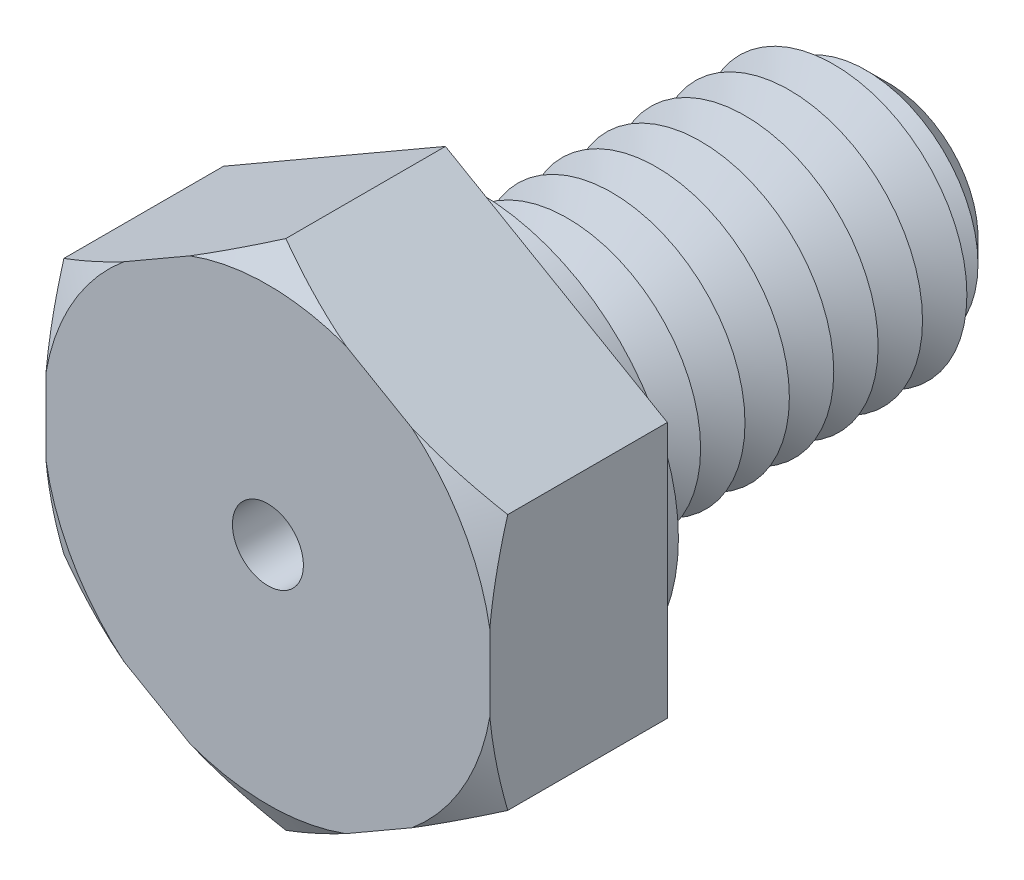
ISO-10303-21;
HEADER;
FILE_DESCRIPTION(('STEP AP214'),'2;1');
FILE_NAME('part.step','',(''),(''),'','','');
FILE_SCHEMA(('AUTOMOTIVE_DESIGN { 1 0 10303 214 1 1 1 1 }'));
ENDSEC;
DATA;
#1=APPLICATION_CONTEXT('core data for automotive mechanical design processes');
#2=APPLICATION_PROTOCOL_DEFINITION('international standard','automotive_design',2000,#1);
#3=PRODUCT_CONTEXT('',#1,'mechanical');
#4=PRODUCT('Part','Part','',(#3));
#5=PRODUCT_RELATED_PRODUCT_CATEGORY('part','',(#4));
#6=PRODUCT_DEFINITION_FORMATION('','',#4);
#7=PRODUCT_DEFINITION_CONTEXT('part definition',#1,'design');
#8=PRODUCT_DEFINITION('design','',#6,#7);
#9=PRODUCT_DEFINITION_SHAPE('','',#8);
#10=(LENGTH_UNIT() NAMED_UNIT(*) SI_UNIT(.MILLI.,.METRE.));
#11=(NAMED_UNIT(*) PLANE_ANGLE_UNIT() SI_UNIT($,.RADIAN.));
#12=(NAMED_UNIT(*) SI_UNIT($,.STERADIAN.) SOLID_ANGLE_UNIT());
#13=UNCERTAINTY_MEASURE_WITH_UNIT(LENGTH_MEASURE(1.E-05),#10,'distance_accuracy_value','');
#14=(GEOMETRIC_REPRESENTATION_CONTEXT(3) GLOBAL_UNCERTAINTY_ASSIGNED_CONTEXT((#13)) GLOBAL_UNIT_ASSIGNED_CONTEXT((#10,
#11,#12)) REPRESENTATION_CONTEXT('',''));
#15=CARTESIAN_POINT('',(0.,0.,0.));
#16=DIRECTION('',(0.,0.,1.));
#17=DIRECTION('',(1.,0.,0.));
#18=AXIS2_PLACEMENT_3D('',#15,#16,#17);
#19=CARTESIAN_POINT('',(5.,2.88675134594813,4.));
#20=DIRECTION('',(-0.5,-0.866025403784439,0.));
#21=DIRECTION('',(0.866025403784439,-0.5,0.));
#22=AXIS2_PLACEMENT_3D('',#19,#20,#21);
#23=PLANE('',#22);
#24=CARTESIAN_POINT('',(8.47277829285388,0.881741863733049,2.01100959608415));
#25=CARTESIAN_POINT('',(8.31567675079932,0.972444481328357,2.09578624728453));
#26=CARTESIAN_POINT('',(8.15819937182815,1.06336408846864,2.17964850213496));
#27=CARTESIAN_POINT('',(7.84233445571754,1.24572878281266,2.34511482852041));
#28=CARTESIAN_POINT('',(7.68394680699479,1.33717393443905,2.42671861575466));
#29=CARTESIAN_POINT('',(7.3656324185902,1.52095283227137,2.58747458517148));
#30=CARTESIAN_POINT('',(7.2057023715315,1.61328848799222,2.66661806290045));
#31=CARTESIAN_POINT('',(6.88464436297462,1.79865141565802,2.82158887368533));
#32=CARTESIAN_POINT('',(6.72351643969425,1.89167866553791,2.89741631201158));
#33=CARTESIAN_POINT('',(6.39574451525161,2.08091787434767,3.04691088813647));
#34=CARTESIAN_POINT('',(6.22906463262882,2.17715054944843,3.12047362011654));
#35=CARTESIAN_POINT('',(5.89404164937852,2.3705761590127,3.26235309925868));
#36=CARTESIAN_POINT('',(5.72569864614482,2.46776903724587,3.33067015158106));
#37=CARTESIAN_POINT('',(5.38728347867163,2.66315312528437,3.46077059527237));
#38=CARTESIAN_POINT('',(5.21721304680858,2.7613433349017,3.52255993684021));
#39=CARTESIAN_POINT('',(4.87507545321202,2.95887656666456,3.63817490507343));
#40=CARTESIAN_POINT('',(4.70300855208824,3.058219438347,3.69200155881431));
#41=CARTESIAN_POINT('',(4.29152467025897,3.29578976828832,3.8084273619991));
#42=CARTESIAN_POINT('',(4.05114917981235,3.43457062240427,3.86669526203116));
#43=CARTESIAN_POINT('',(3.68812002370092,3.64416560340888,3.93673911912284));
#44=CARTESIAN_POINT('',(3.56670137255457,3.71426669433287,3.95719387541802));
#45=CARTESIAN_POINT('',(3.32319777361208,3.85485356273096,3.99180309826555));
#46=CARTESIAN_POINT('',(3.20111291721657,3.92533928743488,4.0059584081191));
#47=CARTESIAN_POINT('',(2.95790980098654,4.06575267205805,4.0274398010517));
#48=CARTESIAN_POINT('',(2.83679666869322,4.13567737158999,4.03484289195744));
#49=CARTESIAN_POINT('',(2.59440145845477,4.27562431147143,4.04287861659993));
#50=CARTESIAN_POINT('',(2.47311938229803,4.34564655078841,4.0435113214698));
#51=CARTESIAN_POINT('',(2.23067249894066,4.48562332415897,4.03798617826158));
#52=CARTESIAN_POINT('',(2.10950769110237,4.55557785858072,4.03182836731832));
#53=CARTESIAN_POINT('',(1.86755304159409,4.695270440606,4.01290860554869));
#54=CARTESIAN_POINT('',(1.7467632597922,4.76500845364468,4.00014564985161));
#55=CARTESIAN_POINT('',(1.46148107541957,4.92971619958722,3.96252552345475));
#56=CARTESIAN_POINT('',(1.29725580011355,5.02453170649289,3.93494657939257));
#57=CARTESIAN_POINT('',(0.970375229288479,5.21325629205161,3.86938275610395));
#58=CARTESIAN_POINT('',(0.807720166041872,5.30716523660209,3.83139636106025));
#59=CARTESIAN_POINT('',(0.484000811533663,5.4940646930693,3.7464515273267));
#60=CARTESIAN_POINT('',(0.32293853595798,5.58705404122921,3.6994829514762));
#61=CARTESIAN_POINT('',(0.00262118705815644,5.77198934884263,3.59805355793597));
#62=CARTESIAN_POINT('',(-0.156634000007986,5.86393537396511,3.54359321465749));
#63=CARTESIAN_POINT('',(-0.475335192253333,6.04793759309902,3.42778810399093));
#64=CARTESIAN_POINT('',(-0.63476076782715,6.13998199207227,3.36636889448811));
#65=CARTESIAN_POINT('',(-0.951922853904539,6.3230956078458,3.2383676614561));
#66=CARTESIAN_POINT('',(-1.10966040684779,6.4141654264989,3.17178906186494));
#67=CARTESIAN_POINT('',(-1.42369760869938,6.59547488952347,3.03438397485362));
#68=CARTESIAN_POINT('',(-1.57999755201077,6.68571470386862,2.96355838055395));
#69=CARTESIAN_POINT('',(-1.89137153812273,6.86548655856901,2.81840247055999));
#70=CARTESIAN_POINT('',(-2.04644555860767,6.95501858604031,2.74407209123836));
#71=CARTESIAN_POINT('',(-2.30843737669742,7.1062796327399,2.61560341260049));
#72=CARTESIAN_POINT('',(-2.41563149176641,7.16816818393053,2.5622132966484));
#73=CARTESIAN_POINT('',(-2.62954890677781,7.29167346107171,2.45420118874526));
#74=CARTESIAN_POINT('',(-2.73627222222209,7.35329019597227,2.39957923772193));
#75=CARTESIAN_POINT('',(-2.94817046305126,7.4756297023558,2.28983212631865));
#76=CARTESIAN_POINT('',(-3.05334983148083,7.53635503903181,2.23471838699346));
#77=CARTESIAN_POINT('',(-3.26333506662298,7.65759007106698,2.12354428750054));
#78=CARTESIAN_POINT('',(-3.36814092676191,7.71809976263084,2.06748391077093));
#79=CARTESIAN_POINT('',(-3.47277829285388,7.77851217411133,2.01100959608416));
#80=B_SPLINE_CURVE_WITH_KNOTS('',3,(#24,#25,#26,#27,#28,#29,#30,#31,#32,#33,#34,#35,#36,#37,#38,
#39,#40,#41,#42,#43,#44,#45,#46,#47,#48,#49,#50,#51,#52,#53,#54,#55,#56,#57,#58,#59,#60,#61,#62,
#63,#64,#65,#66,#67,#68,#69,#70,#71,#72,#73,#74,#75,#76,#77,#78,#79),.UNSPECIFIED.,.F.,.F.,(4,2,
2,2,2,2,2,2,2,2,2,2,2,2,2,2,2,2,2,2,2,2,2,2,2,2,2,4),(0.,0.600718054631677,1.20151138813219,
1.80423204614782,2.40693355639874,3.02500509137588,3.64304064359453,4.26050788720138,
4.87789541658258,5.72780796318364,6.15275000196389,6.57763513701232,6.99761163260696,
7.41758371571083,7.83755350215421,8.25758719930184,8.83211758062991,9.40673168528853,
9.98199815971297,10.5572282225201,11.1393271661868,11.7210430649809,12.3026370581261,
12.8842416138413,13.2886376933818,13.6930203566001,14.0931288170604,14.493244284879),.UNSPECIFIED.);
#81=CARTESIAN_POINT('',(5.,2.88675134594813,3.59585481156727));
#82=VERTEX_POINT('',#81);
#83=CARTESIAN_POINT('',(3.24519941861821,3.89988593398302,4.));
#84=VERTEX_POINT('',#83);
#85=EDGE_CURVE('E132',#82,#84,#80,.T.);
#86=ORIENTED_EDGE('',*,*,#85,.F.);
#87=DIRECTION('',(0.,0.,-1.));
#88=VECTOR('',#87,1.);
#89=CARTESIAN_POINT('',(5.,2.88675134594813,4.));
#90=LINE('',#89,#88);
#91=CARTESIAN_POINT('',(5.,2.88675134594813,0.));
#92=VERTEX_POINT('',#91);
#93=EDGE_CURVE('E144',#82,#92,#90,.T.);
#94=ORIENTED_EDGE('',*,*,#93,.T.);
#95=DIRECTION('',(-0.866025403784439,0.5,0.));
#96=VECTOR('',#95,1.);
#97=CARTESIAN_POINT('',(5.,2.88675134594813,0.));
#98=LINE('',#97,#96);
#99=CARTESIAN_POINT('',(0.,5.77350269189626,0.));
#100=VERTEX_POINT('',#99);
#101=EDGE_CURVE('E273',#92,#100,#98,.T.);
#102=ORIENTED_EDGE('',*,*,#101,.T.);
#103=DIRECTION('',(0.,0.,-1.));
#104=VECTOR('',#103,1.);
#105=CARTESIAN_POINT('',(0.,5.77350269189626,4.));
#106=LINE('',#105,#104);
#107=CARTESIAN_POINT('',(0.,5.77350269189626,3.59585481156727));
#108=VERTEX_POINT('',#107);
#109=EDGE_CURVE('E179',#108,#100,#106,.T.);
#110=ORIENTED_EDGE('',*,*,#109,.F.);
#111=CARTESIAN_POINT('',(1.75480058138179,4.76036810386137,4.));
#112=VERTEX_POINT('',#111);
#113=EDGE_CURVE('E151',#112,#108,#80,.T.);
#114=ORIENTED_EDGE('',*,*,#113,.F.);
#115=DIRECTION('',(-0.866025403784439,0.5,0.));
#116=VECTOR('',#115,1.);
#117=CARTESIAN_POINT('',(5.,2.88675134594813,4.));
#118=LINE('',#117,#116);
#119=EDGE_CURVE('E148',#84,#112,#118,.T.);
#120=ORIENTED_EDGE('',*,*,#119,.F.);
#121=EDGE_LOOP('',(#86,#94,#102,#110,#114,#120));
#122=FACE_BOUND('',#121,.T.);
#123=ADVANCED_FACE('F39',(#122),#23,.F.);
#124=CARTESIAN_POINT('',(0.,5.77350269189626,4.));
#125=DIRECTION('',(0.5,-0.866025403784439,0.));
#126=DIRECTION('',(0.866025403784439,0.5,0.));
#127=AXIS2_PLACEMENT_3D('',#124,#125,#126);
#128=PLANE('',#127);
#129=CARTESIAN_POINT('',(3.47277829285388,7.77851217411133,2.01100959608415));
#130=CARTESIAN_POINT('',(3.31567675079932,7.68780955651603,2.09578624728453));
#131=CARTESIAN_POINT('',(3.15819937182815,7.59688994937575,2.17964850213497));
#132=CARTESIAN_POINT('',(2.84233445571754,7.41452525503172,2.34511482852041));
#133=CARTESIAN_POINT('',(2.68394680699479,7.32308010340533,2.42671861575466));
#134=CARTESIAN_POINT('',(2.36563241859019,7.13930120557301,2.58747458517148));
#135=CARTESIAN_POINT('',(2.2057023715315,7.04696554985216,2.66661806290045));
#136=CARTESIAN_POINT('',(1.88464436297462,6.86160262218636,2.82158887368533));
#137=CARTESIAN_POINT('',(1.72351643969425,6.76857537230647,2.89741631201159));
#138=CARTESIAN_POINT('',(1.39574451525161,6.57933616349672,3.04691088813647));
#139=CARTESIAN_POINT('',(1.22906463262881,6.48310348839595,3.12047362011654));
#140=CARTESIAN_POINT('',(0.894041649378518,6.28967787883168,3.26235309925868));
#141=CARTESIAN_POINT('',(0.725698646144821,6.19248500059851,3.33067015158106));
#142=CARTESIAN_POINT('',(0.38728347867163,5.99710091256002,3.46077059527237));
#143=CARTESIAN_POINT('',(0.217213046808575,5.89891070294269,3.52255993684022));
#144=CARTESIAN_POINT('',(-0.124924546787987,5.70137747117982,3.63817490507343));
#145=CARTESIAN_POINT('',(-0.296991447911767,5.60203459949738,3.69200155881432));
#146=CARTESIAN_POINT('',(-0.708475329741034,5.36446426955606,3.8084273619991));
#147=CARTESIAN_POINT('',(-0.948850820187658,5.22568341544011,3.86669526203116));
#148=CARTESIAN_POINT('',(-1.31187997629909,5.0160884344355,3.93673911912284));
#149=CARTESIAN_POINT('',(-1.43329862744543,4.94598734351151,3.95719387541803));
#150=CARTESIAN_POINT('',(-1.67680222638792,4.80540047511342,3.99180309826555));
#151=CARTESIAN_POINT('',(-1.79888708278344,4.7349147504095,4.0059584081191));
#152=CARTESIAN_POINT('',(-2.04209019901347,4.59450136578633,4.0274398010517));
#153=CARTESIAN_POINT('',(-2.16320333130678,4.52457666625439,4.03484289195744));
#154=CARTESIAN_POINT('',(-2.40559854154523,4.38462972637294,4.04287861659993));
#155=CARTESIAN_POINT('',(-2.52688061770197,4.31460748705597,4.04351132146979));
#156=CARTESIAN_POINT('',(-2.76932750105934,4.17463071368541,4.03798617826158));
#157=CARTESIAN_POINT('',(-2.89049230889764,4.10467617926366,4.03182836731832));
#158=CARTESIAN_POINT('',(-3.13244695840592,3.96498359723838,4.01290860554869));
#159=CARTESIAN_POINT('',(-3.25323674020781,3.8952455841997,4.00014564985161));
#160=CARTESIAN_POINT('',(-3.53851892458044,3.73053783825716,3.96252552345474));
#161=CARTESIAN_POINT('',(-3.70274419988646,3.63572233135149,3.93494657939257));
#162=CARTESIAN_POINT('',(-4.02962477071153,3.44699774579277,3.86938275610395));
#163=CARTESIAN_POINT('',(-4.19227983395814,3.35308880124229,3.83139636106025));
#164=CARTESIAN_POINT('',(-4.51599918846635,3.16618934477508,3.7464515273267));
#165=CARTESIAN_POINT('',(-4.67706146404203,3.07319999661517,3.6994829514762));
#166=CARTESIAN_POINT('',(-4.99737881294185,2.88826468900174,3.59805355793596));
#167=CARTESIAN_POINT('',(-5.156634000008,2.79631866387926,3.54359321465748));
#168=CARTESIAN_POINT('',(-5.47533519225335,2.61231644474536,3.42778810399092));
#169=CARTESIAN_POINT('',(-5.63476076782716,2.5202720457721,3.3663688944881));
#170=CARTESIAN_POINT('',(-5.95192285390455,2.33715842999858,3.23836766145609));
#171=CARTESIAN_POINT('',(-6.10966040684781,2.24608861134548,3.17178906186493));
#172=CARTESIAN_POINT('',(-6.4236976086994,2.0647791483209,3.03438397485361));
#173=CARTESIAN_POINT('',(-6.57999755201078,1.97453933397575,2.96355838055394));
#174=CARTESIAN_POINT('',(-6.89137153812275,1.79476747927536,2.81840247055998));
#175=CARTESIAN_POINT('',(-7.04644555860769,1.70523545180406,2.74407209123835));
#176=CARTESIAN_POINT('',(-7.30843737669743,1.55397440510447,2.61560341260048));
#177=CARTESIAN_POINT('',(-7.41563149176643,1.49208585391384,2.56221329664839));
#178=CARTESIAN_POINT('',(-7.62954890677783,1.36858057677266,2.45420118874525));
#179=CARTESIAN_POINT('',(-7.7362722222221,1.30696384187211,2.39957923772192));
#180=CARTESIAN_POINT('',(-7.94817046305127,1.18462433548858,2.28983212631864));
#181=CARTESIAN_POINT('',(-8.05334983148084,1.12389899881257,2.23471838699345));
#182=CARTESIAN_POINT('',(-8.26333506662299,1.0026639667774,2.12354428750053));
#183=CARTESIAN_POINT('',(-8.36814092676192,0.94215427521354,2.06748391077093));
#184=CARTESIAN_POINT('',(-8.47277829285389,0.881741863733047,2.01100959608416));
#185=B_SPLINE_CURVE_WITH_KNOTS('',3,(#129,#130,#131,#132,#133,#134,#135,#136,#137,#138,#139,
#140,#141,#142,#143,#144,#145,#146,#147,#148,#149,#150,#151,#152,#153,#154,#155,#156,#157,#158,
#159,#160,#161,#162,#163,#164,#165,#166,#167,#168,#169,#170,#171,#172,#173,#174,#175,#176,#177,
#178,#179,#180,#181,#182,#183,#184),.UNSPECIFIED.,.F.,.F.,(4,2,2,2,2,2,2,2,2,2,2,2,2,2,2,2,2,2,
2,2,2,2,2,2,2,2,2,4),(0.,0.600718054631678,1.20151138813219,1.80423204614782,2.40693355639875,
3.02500509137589,3.64304064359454,4.26050788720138,4.87789541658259,5.72780796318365,
6.1527500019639,6.57763513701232,6.99761163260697,7.41758371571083,7.83755350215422,
8.25758719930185,8.83211758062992,9.40673168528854,9.98199815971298,10.5572282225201,
11.1393271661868,11.7210430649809,12.3026370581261,12.8842416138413,13.2886376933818,
13.6930203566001,14.0931288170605,14.493244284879),.UNSPECIFIED.);
#186=CARTESIAN_POINT('',(-1.75480058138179,4.76036810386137,4.));
#187=VERTEX_POINT('',#186);
#188=EDGE_CURVE('E313',#108,#187,#185,.T.);
#189=ORIENTED_EDGE('',*,*,#188,.F.);
#190=ORIENTED_EDGE('',*,*,#109,.T.);
#191=DIRECTION('',(-0.866025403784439,-0.5,0.));
#192=VECTOR('',#191,1.);
#193=CARTESIAN_POINT('',(0.,5.77350269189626,0.));
#194=LINE('',#193,#192);
#195=CARTESIAN_POINT('',(-5.,2.88675134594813,0.));
#196=VERTEX_POINT('',#195);
#197=EDGE_CURVE('E293',#100,#196,#194,.T.);
#198=ORIENTED_EDGE('',*,*,#197,.T.);
#199=DIRECTION('',(0.,0.,-1.));
#200=VECTOR('',#199,1.);
#201=CARTESIAN_POINT('',(-5.,2.88675134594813,4.));
#202=LINE('',#201,#200);
#203=CARTESIAN_POINT('',(-5.,2.88675134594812,3.59585481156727));
#204=VERTEX_POINT('',#203);
#205=EDGE_CURVE('E176',#204,#196,#202,.T.);
#206=ORIENTED_EDGE('',*,*,#205,.F.);
#207=CARTESIAN_POINT('',(-3.24519941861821,3.89988593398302,4.));
#208=VERTEX_POINT('',#207);
#209=EDGE_CURVE('E389',#208,#204,#185,.T.);
#210=ORIENTED_EDGE('',*,*,#209,.F.);
#211=DIRECTION('',(-0.866025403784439,-0.5,0.));
#212=VECTOR('',#211,1.);
#213=CARTESIAN_POINT('',(0.,5.77350269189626,4.));
#214=LINE('',#213,#212);
#215=EDGE_CURVE('E276',#187,#208,#214,.T.);
#216=ORIENTED_EDGE('',*,*,#215,.F.);
#217=EDGE_LOOP('',(#189,#190,#198,#206,#210,#216));
#218=FACE_BOUND('',#217,.T.);
#219=ADVANCED_FACE('F383',(#218),#128,.F.);
#220=CARTESIAN_POINT('',(-5.,2.88675134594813,4.));
#221=DIRECTION('',(1.,0.,0.));
#222=DIRECTION('',(0.,0.,-1.));
#223=AXIS2_PLACEMENT_3D('',#220,#221,#222);
#224=PLANE('',#223);
#225=CARTESIAN_POINT('',(-5.,6.35952963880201,2.25858442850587));
#226=CARTESIAN_POINT('',(-5.,6.17888675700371,2.34055079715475));
#227=CARTESIAN_POINT('',(-5.,5.99774985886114,2.42144915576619));
#228=CARTESIAN_POINT('',(-5.,5.63427640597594,2.58059164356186));
#229=CARTESIAN_POINT('',(-5.,5.45193964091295,2.65883529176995));
#230=CARTESIAN_POINT('',(-5.,5.08515575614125,2.81244019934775));
#231=CARTESIAN_POINT('',(-5.,4.90070300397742,2.8877880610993));
#232=CARTESIAN_POINT('',(-5.,4.53023851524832,3.0345384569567));
#233=CARTESIAN_POINT('',(-5.,4.34422685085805,3.10594117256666));
#234=CARTESIAN_POINT('',(-5.,3.9712497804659,3.24361472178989));
#235=CARTESIAN_POINT('',(-5.,3.78429235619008,3.30990707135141));
#236=CARTESIAN_POINT('',(-5.,3.40837814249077,3.43663614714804));
#237=CARTESIAN_POINT('',(-5.,3.21942124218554,3.49707254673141));
#238=CARTESIAN_POINT('',(-5.,2.83960832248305,3.61070280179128));
#239=CARTESIAN_POINT('',(-5.,2.64875526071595,3.66390646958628));
#240=CARTESIAN_POINT('',(-5.,2.26482213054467,3.76165698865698));
#241=CARTESIAN_POINT('',(-5.,2.07174215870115,3.80620421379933));
#242=CARTESIAN_POINT('',(-5.,1.7384332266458,3.87385543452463));
#243=CARTESIAN_POINT('',(-5.,1.59871159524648,3.89946008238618));
#244=CARTESIAN_POINT('',(-5.,1.31833206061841,3.94478995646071));
#245=CARTESIAN_POINT('',(-5.,1.17767431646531,3.96451615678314));
#246=CARTESIAN_POINT('',(-5.,0.895629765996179,3.99757345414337));
#247=CARTESIAN_POINT('',(-5.,0.754243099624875,4.01090573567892));
#248=CARTESIAN_POINT('',(-5.,0.470989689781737,4.03079351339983));
#249=CARTESIAN_POINT('',(-5.,0.329122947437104,4.03734902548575));
#250=CARTESIAN_POINT('',(-5.,0.0453101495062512,4.04347876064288));
#251=CARTESIAN_POINT('',(-5.,-0.0966358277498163,4.04305657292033));
#252=CARTESIAN_POINT('',(-5.,-0.380333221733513,4.03525341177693));
#253=CARTESIAN_POINT('',(-5.,-0.522084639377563,4.02787247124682));
#254=CARTESIAN_POINT('',(-5.,-0.805078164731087,4.00637695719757));
#255=CARTESIAN_POINT('',(-5.,-0.946320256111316,3.99226216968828));
#256=CARTESIAN_POINT('',(-5.,-1.22803871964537,3.95770663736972));
#257=CARTESIAN_POINT('',(-5.,-1.36851494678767,3.93726473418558));
#258=CARTESIAN_POINT('',(-5.,-1.92842653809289,3.84388033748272));
#259=CARTESIAN_POINT('',(-5.,-2.34409397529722,3.74768165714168));
#260=CARTESIAN_POINT('',(-5.,-2.95991397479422,3.57615402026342));
#261=CARTESIAN_POINT('',(-5.,-3.16417440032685,3.51433916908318));
#262=CARTESIAN_POINT('',(-5.,-3.57033913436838,3.3833457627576));
#263=CARTESIAN_POINT('',(-5.,-3.77224360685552,3.31416772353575));
#264=CARTESIAN_POINT('',(-5.,-4.17620397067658,3.16907432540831));
#265=CARTESIAN_POINT('',(-5.,-4.37823505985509,3.09309081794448));
#266=CARTESIAN_POINT('',(-5.,-4.78041106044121,2.93626257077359));
#267=CARTESIAN_POINT('',(-5.,-4.98055585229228,2.85541752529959));
#268=CARTESIAN_POINT('',(-5.,-5.37797431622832,2.69033488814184));
#269=CARTESIAN_POINT('',(-5.,-5.57525810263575,2.60612151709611));
#270=CARTESIAN_POINT('',(-5.,-5.96839598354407,2.43454627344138));
#271=CARTESIAN_POINT('',(-5.,-6.16425041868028,2.34718518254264));
#272=CARTESIAN_POINT('',(-5.,-6.35952963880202,2.25858442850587));
#273=B_SPLINE_CURVE_WITH_KNOTS('',3,(#225,#226,#227,#228,#229,#230,#231,#232,#233,#234,#235,
#236,#237,#238,#239,#240,#241,#242,#243,#244,#245,#246,#247,#248,#249,#250,#251,#252,#253,#254,
#255,#256,#257,#258,#259,#260,#261,#262,#263,#264,#265,#266,#267,#268,#269,#270,#271,#272),
.UNSPECIFIED.,.F.,.F.,(4,2,2,2,2,2,2,2,2,2,2,2,2,2,2,2,2,2,2,2,2,2,2,4),(0.,0.595116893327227,
1.19034103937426,1.78805021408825,2.3857318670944,2.98074146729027,3.57578423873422,
4.17001151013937,4.7642131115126,5.19024951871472,5.61621528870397,6.0421021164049,
6.46798794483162,6.89365471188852,7.3193194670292,7.74499774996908,8.17075401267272,
9.44769357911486,10.0878733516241,10.7280082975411,11.3754821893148,12.0229968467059,
12.6664852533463,13.3098149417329),.UNSPECIFIED.);
#274=CARTESIAN_POINT('',(-5.,0.86048216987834,4.));
#275=VERTEX_POINT('',#274);
#276=EDGE_CURVE('E394',#204,#275,#273,.T.);
#277=ORIENTED_EDGE('',*,*,#276,.F.);
#278=ORIENTED_EDGE('',*,*,#205,.T.);
#279=DIRECTION('',(0.,-1.,0.));
#280=VECTOR('',#279,1.);
#281=CARTESIAN_POINT('',(-5.,2.88675134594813,0.));
#282=LINE('',#281,#280);
#283=CARTESIAN_POINT('',(-5.,-2.88675134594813,0.));
#284=VERTEX_POINT('',#283);
#285=EDGE_CURVE('E297',#196,#284,#282,.T.);
#286=ORIENTED_EDGE('',*,*,#285,.T.);
#287=DIRECTION('',(0.,0.,-1.));
#288=VECTOR('',#287,1.);
#289=CARTESIAN_POINT('',(-5.,-2.88675134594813,4.));
#290=LINE('',#289,#288);
#291=CARTESIAN_POINT('',(-4.99999999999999,-2.88675134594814,3.59585481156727));
#292=VERTEX_POINT('',#291);
#293=EDGE_CURVE('E173',#292,#284,#290,.T.);
#294=ORIENTED_EDGE('',*,*,#293,.F.);
#295=CARTESIAN_POINT('',(-5.,-0.86048216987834,4.));
#296=VERTEX_POINT('',#295);
#297=EDGE_CURVE('E316',#296,#292,#273,.T.);
#298=ORIENTED_EDGE('',*,*,#297,.F.);
#299=DIRECTION('',(0.,-1.,0.));
#300=VECTOR('',#299,1.);
#301=CARTESIAN_POINT('',(-5.,2.88675134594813,4.));
#302=LINE('',#301,#300);
#303=EDGE_CURVE('E280',#275,#296,#302,.T.);
#304=ORIENTED_EDGE('',*,*,#303,.F.);
#305=EDGE_LOOP('',(#277,#278,#286,#294,#298,#304));
#306=FACE_BOUND('',#305,.T.);
#307=ADVANCED_FACE('F386',(#306),#224,.F.);
#308=CARTESIAN_POINT('',(-5.,-2.88675134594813,4.));
#309=DIRECTION('',(0.5,0.866025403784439,0.));
#310=DIRECTION('',(-0.866025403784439,0.5,0.));
#311=AXIS2_PLACEMENT_3D('',#308,#309,#310);
#312=PLANE('',#311);
#313=CARTESIAN_POINT('',(-8.47277829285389,-0.881741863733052,2.01100959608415));
#314=CARTESIAN_POINT('',(-8.31567675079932,-0.972444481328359,2.09578624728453));
#315=CARTESIAN_POINT('',(-8.15819937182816,-1.06336408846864,2.17964850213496));
#316=CARTESIAN_POINT('',(-7.84233445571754,-1.24572878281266,2.34511482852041));
#317=CARTESIAN_POINT('',(-7.68394680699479,-1.33717393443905,2.42671861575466));
#318=CARTESIAN_POINT('',(-7.3656324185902,-1.52095283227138,2.58747458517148));
#319=CARTESIAN_POINT('',(-7.2057023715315,-1.61328848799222,2.66661806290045));
#320=CARTESIAN_POINT('',(-6.88464436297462,-1.79865141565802,2.82158887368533));
#321=CARTESIAN_POINT('',(-6.72351643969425,-1.89167866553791,2.89741631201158));
#322=CARTESIAN_POINT('',(-6.39574451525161,-2.08091787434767,3.04691088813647));
#323=CARTESIAN_POINT('',(-6.22906463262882,-2.17715054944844,3.12047362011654));
#324=CARTESIAN_POINT('',(-5.89404164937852,-2.37057615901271,3.26235309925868));
#325=CARTESIAN_POINT('',(-5.72569864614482,-2.46776903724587,3.33067015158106));
#326=CARTESIAN_POINT('',(-5.38728347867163,-2.66315312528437,3.46077059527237));
#327=CARTESIAN_POINT('',(-5.21721304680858,-2.7613433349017,3.52255993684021));
#328=CARTESIAN_POINT('',(-4.87507545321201,-2.95887656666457,3.63817490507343));
#329=CARTESIAN_POINT('',(-4.70300855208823,-3.05821943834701,3.69200155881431));
#330=CARTESIAN_POINT('',(-4.29152467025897,-3.29578976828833,3.8084273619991));
#331=CARTESIAN_POINT('',(-4.05114917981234,-3.43457062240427,3.86669526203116));
#332=CARTESIAN_POINT('',(-3.68812002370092,-3.64416560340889,3.93673911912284));
#333=CARTESIAN_POINT('',(-3.56670137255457,-3.71426669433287,3.95719387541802));
#334=CARTESIAN_POINT('',(-3.32319777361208,-3.85485356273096,3.99180309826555));
#335=CARTESIAN_POINT('',(-3.20111291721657,-3.92533928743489,4.0059584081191));
#336=CARTESIAN_POINT('',(-2.95790980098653,-4.06575267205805,4.0274398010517));
#337=CARTESIAN_POINT('',(-2.83679666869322,-4.13567737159,4.03484289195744));
#338=CARTESIAN_POINT('',(-2.59440145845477,-4.27562431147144,4.04287861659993));
#339=CARTESIAN_POINT('',(-2.47311938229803,-4.34564655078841,4.04351132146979));
#340=CARTESIAN_POINT('',(-2.23067249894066,-4.48562332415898,4.03798617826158));
#341=CARTESIAN_POINT('',(-2.10950769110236,-4.55557785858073,4.03182836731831));
#342=CARTESIAN_POINT('',(-1.86755304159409,-4.69527044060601,4.01290860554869));
#343=CARTESIAN_POINT('',(-1.74676325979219,-4.76500845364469,4.00014564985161));
#344=CARTESIAN_POINT('',(-1.46148107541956,-4.92971619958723,3.96252552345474));
#345=CARTESIAN_POINT('',(-1.29725580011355,-5.0245317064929,3.93494657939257));
#346=CARTESIAN_POINT('',(-0.970375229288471,-5.21325629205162,3.86938275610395));
#347=CARTESIAN_POINT('',(-0.807720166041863,-5.3071652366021,3.83139636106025));
#348=CARTESIAN_POINT('',(-0.484000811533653,-5.49406469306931,3.7464515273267));
#349=CARTESIAN_POINT('',(-0.322938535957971,-5.58705404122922,3.6994829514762));
#350=CARTESIAN_POINT('',(-0.00262118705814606,-5.77198934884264,3.59805355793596));
#351=CARTESIAN_POINT('',(0.156634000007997,-5.86393537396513,3.54359321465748));
#352=CARTESIAN_POINT('',(0.475335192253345,-6.04793759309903,3.42778810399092));
#353=CARTESIAN_POINT('',(0.634760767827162,-6.13998199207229,3.3663688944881));
#354=CARTESIAN_POINT('',(0.951922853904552,-6.32309560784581,3.23836766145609));
#355=CARTESIAN_POINT('',(1.10966040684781,-6.41416542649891,3.17178906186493));
#356=CARTESIAN_POINT('',(1.4236976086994,-6.59547488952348,3.03438397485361));
#357=CARTESIAN_POINT('',(1.57999755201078,-6.68571470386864,2.96355838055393));
#358=CARTESIAN_POINT('',(1.89137153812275,-6.86548655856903,2.81840247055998));
#359=CARTESIAN_POINT('',(2.04644555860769,-6.95501858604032,2.74407209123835));
#360=CARTESIAN_POINT('',(2.30843737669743,-7.10627963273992,2.61560341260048));
#361=CARTESIAN_POINT('',(2.41563149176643,-7.16816818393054,2.56221329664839));
#362=CARTESIAN_POINT('',(2.62954890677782,-7.29167346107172,2.45420118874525));
#363=CARTESIAN_POINT('',(2.73627222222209,-7.35329019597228,2.39957923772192));
#364=CARTESIAN_POINT('',(2.94817046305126,-7.47562970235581,2.28983212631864));
#365=CARTESIAN_POINT('',(3.05334983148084,-7.53635503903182,2.23471838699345));
#366=CARTESIAN_POINT('',(3.26333506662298,-7.65759007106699,2.12354428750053));
#367=CARTESIAN_POINT('',(3.36814092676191,-7.71809976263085,2.06748391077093));
#368=CARTESIAN_POINT('',(3.47277829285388,-7.77851217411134,2.01100959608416));
#369=B_SPLINE_CURVE_WITH_KNOTS('',3,(#313,#314,#315,#316,#317,#318,#319,#320,#321,#322,#323,
#324,#325,#326,#327,#328,#329,#330,#331,#332,#333,#334,#335,#336,#337,#338,#339,#340,#341,#342,
#343,#344,#345,#346,#347,#348,#349,#350,#351,#352,#353,#354,#355,#356,#357,#358,#359,#360,#361,
#362,#363,#364,#365,#366,#367,#368),.UNSPECIFIED.,.F.,.F.,(4,2,2,2,2,2,2,2,2,2,2,2,2,2,2,2,2,2,
2,2,2,2,2,2,2,2,2,4),(0.,0.600718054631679,1.20151138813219,1.80423204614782,2.40693355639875,
3.02500509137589,3.64304064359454,4.26050788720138,4.87789541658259,5.72780796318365,
6.1527500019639,6.57763513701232,6.99761163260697,7.41758371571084,7.83755350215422,
8.25758719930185,8.83211758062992,9.40673168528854,9.98199815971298,10.5572282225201,
11.1393271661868,11.7210430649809,12.3026370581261,12.8842416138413,13.2886376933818,
13.6930203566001,14.0931288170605,14.493244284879),.UNSPECIFIED.);
#370=CARTESIAN_POINT('',(-3.24519941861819,-3.89988593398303,4.));
#371=VERTEX_POINT('',#370);
#372=EDGE_CURVE('E315',#292,#371,#369,.T.);
#373=ORIENTED_EDGE('',*,*,#372,.F.);
#374=ORIENTED_EDGE('',*,*,#293,.T.);
#375=DIRECTION('',(0.866025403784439,-0.5,0.));
#376=VECTOR('',#375,1.);
#377=CARTESIAN_POINT('',(-5.,-2.88675134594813,0.));
#378=LINE('',#377,#376);
#379=CARTESIAN_POINT('',(0.,-5.77350269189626,0.));
#380=VERTEX_POINT('',#379);
#381=EDGE_CURVE('E301',#284,#380,#378,.T.);
#382=ORIENTED_EDGE('',*,*,#381,.T.);
#383=DIRECTION('',(0.,0.,-1.));
#384=VECTOR('',#383,1.);
#385=CARTESIAN_POINT('',(0.,-5.77350269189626,4.));
#386=LINE('',#385,#384);
#387=CARTESIAN_POINT('',(0.,-5.77350269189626,3.59585481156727));
#388=VERTEX_POINT('',#387);
#389=EDGE_CURVE('E163',#388,#380,#386,.T.);
#390=ORIENTED_EDGE('',*,*,#389,.F.);
#391=CARTESIAN_POINT('',(-1.75480058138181,-4.76036810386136,4.));
#392=VERTEX_POINT('',#391);
#393=EDGE_CURVE('E317',#392,#388,#369,.T.);
#394=ORIENTED_EDGE('',*,*,#393,.F.);
#395=DIRECTION('',(0.866025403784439,-0.5,0.));
#396=VECTOR('',#395,1.);
#397=CARTESIAN_POINT('',(-5.,-2.88675134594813,4.));
#398=LINE('',#397,#396);
#399=EDGE_CURVE('E284',#371,#392,#398,.T.);
#400=ORIENTED_EDGE('',*,*,#399,.F.);
#401=EDGE_LOOP('',(#373,#374,#382,#390,#394,#400));
#402=FACE_BOUND('',#401,.T.);
#403=ADVANCED_FACE('F337',(#402),#312,.F.);
#404=CARTESIAN_POINT('',(0.,-5.77350269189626,4.));
#405=DIRECTION('',(-0.5,0.866025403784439,0.));
#406=DIRECTION('',(-0.866025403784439,-0.5,0.));
#407=AXIS2_PLACEMENT_3D('',#404,#405,#406);
#408=PLANE('',#407);
#409=CARTESIAN_POINT('',(-3.47277829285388,-7.77851217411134,2.01100959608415));
#410=CARTESIAN_POINT('',(-3.31567675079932,-7.68780955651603,2.09578624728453));
#411=CARTESIAN_POINT('',(-3.15819937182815,-7.59688994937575,2.17964850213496));
#412=CARTESIAN_POINT('',(-2.84233445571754,-7.41452525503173,2.34511482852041));
#413=CARTESIAN_POINT('',(-2.68394680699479,-7.32308010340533,2.42671861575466));
#414=CARTESIAN_POINT('',(-2.36563241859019,-7.13930120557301,2.58747458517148));
#415=CARTESIAN_POINT('',(-2.2057023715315,-7.04696554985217,2.66661806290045));
#416=CARTESIAN_POINT('',(-1.88464436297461,-6.86160262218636,2.82158887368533));
#417=CARTESIAN_POINT('',(-1.72351643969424,-6.76857537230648,2.89741631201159));
#418=CARTESIAN_POINT('',(-1.39574451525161,-6.57933616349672,3.04691088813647));
#419=CARTESIAN_POINT('',(-1.22906463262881,-6.48310348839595,3.12047362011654));
#420=CARTESIAN_POINT('',(-0.894041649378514,-6.28967787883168,3.26235309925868));
#421=CARTESIAN_POINT('',(-0.725698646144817,-6.19248500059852,3.33067015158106));
#422=CARTESIAN_POINT('',(-0.387283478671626,-5.99710091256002,3.46077059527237));
#423=CARTESIAN_POINT('',(-0.217213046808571,-5.89891070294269,3.52255993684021));
#424=CARTESIAN_POINT('',(0.124924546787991,-5.70137747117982,3.63817490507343));
#425=CARTESIAN_POINT('',(0.296991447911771,-5.60203459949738,3.69200155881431));
#426=CARTESIAN_POINT('',(0.708475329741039,-5.36446426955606,3.8084273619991));
#427=CARTESIAN_POINT('',(0.948850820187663,-5.22568341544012,3.86669526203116));
#428=CARTESIAN_POINT('',(1.31187997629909,-5.0160884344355,3.93673911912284));
#429=CARTESIAN_POINT('',(1.43329862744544,-4.94598734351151,3.95719387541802));
#430=CARTESIAN_POINT('',(1.67680222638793,-4.80540047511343,3.99180309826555));
#431=CARTESIAN_POINT('',(1.79888708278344,-4.7349147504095,4.0059584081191));
#432=CARTESIAN_POINT('',(2.04209019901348,-4.59450136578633,4.0274398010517));
#433=CARTESIAN_POINT('',(2.16320333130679,-4.52457666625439,4.03484289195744));
#434=CARTESIAN_POINT('',(2.40559854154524,-4.38462972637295,4.04287861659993));
#435=CARTESIAN_POINT('',(2.52688061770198,-4.31460748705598,4.04351132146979));
#436=CARTESIAN_POINT('',(2.76932750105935,-4.17463071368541,4.03798617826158));
#437=CARTESIAN_POINT('',(2.89049230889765,-4.10467617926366,4.03182836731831));
#438=CARTESIAN_POINT('',(3.13244695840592,-3.96498359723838,4.01290860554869));
#439=CARTESIAN_POINT('',(3.25323674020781,-3.8952455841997,4.00014564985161));
#440=CARTESIAN_POINT('',(3.53851892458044,-3.73053783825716,3.96252552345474));
#441=CARTESIAN_POINT('',(3.70274419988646,-3.63572233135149,3.93494657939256));
#442=CARTESIAN_POINT('',(4.02962477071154,-3.44699774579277,3.86938275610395));
#443=CARTESIAN_POINT('',(4.19227983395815,-3.35308880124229,3.83139636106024));
#444=CARTESIAN_POINT('',(4.51599918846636,-3.16618934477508,3.7464515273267));
#445=CARTESIAN_POINT('',(4.67706146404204,-3.07319999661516,3.69948295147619));
#446=CARTESIAN_POINT('',(4.99737881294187,-2.88826468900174,3.59805355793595));
#447=CARTESIAN_POINT('',(5.15663400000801,-2.79631866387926,3.54359321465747));
#448=CARTESIAN_POINT('',(5.47533519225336,-2.61231644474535,3.42778810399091));
#449=CARTESIAN_POINT('',(5.63476076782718,-2.5202720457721,3.3663688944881));
#450=CARTESIAN_POINT('',(5.95192285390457,-2.33715842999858,3.23836766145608));
#451=CARTESIAN_POINT('',(6.10966040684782,-2.24608861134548,3.17178906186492));
#452=CARTESIAN_POINT('',(6.42369760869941,-2.0647791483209,3.0343839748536));
#453=CARTESIAN_POINT('',(6.5799975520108,-1.97453933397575,2.96355838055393));
#454=CARTESIAN_POINT('',(6.89137153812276,-1.79476747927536,2.81840247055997));
#455=CARTESIAN_POINT('',(7.04644555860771,-1.70523545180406,2.74407209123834));
#456=CARTESIAN_POINT('',(7.30843737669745,-1.55397440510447,2.61560341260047));
#457=CARTESIAN_POINT('',(7.41563149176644,-1.49208585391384,2.56221329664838));
#458=CARTESIAN_POINT('',(7.62954890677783,-1.36858057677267,2.45420118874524));
#459=CARTESIAN_POINT('',(7.7362722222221,-1.30696384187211,2.39957923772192));
#460=CARTESIAN_POINT('',(7.94817046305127,-1.18462433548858,2.28983212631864));
#461=CARTESIAN_POINT('',(8.05334983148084,-1.12389899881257,2.23471838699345));
#462=CARTESIAN_POINT('',(8.26333506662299,-1.00266396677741,2.12354428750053));
#463=CARTESIAN_POINT('',(8.36814092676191,-0.942154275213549,2.06748391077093));
#464=CARTESIAN_POINT('',(8.47277829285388,-0.881741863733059,2.01100959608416));
#465=B_SPLINE_CURVE_WITH_KNOTS('',3,(#409,#410,#411,#412,#413,#414,#415,#416,#417,#418,#419,
#420,#421,#422,#423,#424,#425,#426,#427,#428,#429,#430,#431,#432,#433,#434,#435,#436,#437,#438,
#439,#440,#441,#442,#443,#444,#445,#446,#447,#448,#449,#450,#451,#452,#453,#454,#455,#456,#457,
#458,#459,#460,#461,#462,#463,#464),.UNSPECIFIED.,.F.,.F.,(4,2,2,2,2,2,2,2,2,2,2,2,2,2,2,2,2,2,
2,2,2,2,2,2,2,2,2,4),(0.,0.600718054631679,1.20151138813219,1.80423204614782,2.40693355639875,
3.02500509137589,3.64304064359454,4.26050788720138,4.87789541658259,5.72780796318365,
6.1527500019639,6.57763513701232,6.99761163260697,7.41758371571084,7.83755350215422,
8.25758719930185,8.83211758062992,9.40673168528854,9.98199815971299,10.5572282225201,
11.1393271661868,11.7210430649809,12.3026370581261,12.8842416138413,13.2886376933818,
13.6930203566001,14.0931288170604,14.493244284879),.UNSPECIFIED.);
#466=CARTESIAN_POINT('',(1.75480058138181,-4.76036810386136,4.));
#467=VERTEX_POINT('',#466);
#468=EDGE_CURVE('E64',#388,#467,#465,.T.);
#469=ORIENTED_EDGE('',*,*,#468,.F.);
#470=ORIENTED_EDGE('',*,*,#389,.T.);
#471=DIRECTION('',(0.866025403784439,0.5,0.));
#472=VECTOR('',#471,1.);
#473=CARTESIAN_POINT('',(0.,-5.77350269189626,0.));
#474=LINE('',#473,#472);
#475=CARTESIAN_POINT('',(5.,-2.88675134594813,0.));
#476=VERTEX_POINT('',#475);
#477=EDGE_CURVE('E304',#380,#476,#474,.T.);
#478=ORIENTED_EDGE('',*,*,#477,.T.);
#479=DIRECTION('',(0.,0.,-1.));
#480=VECTOR('',#479,1.);
#481=CARTESIAN_POINT('',(5.,-2.88675134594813,4.));
#482=LINE('',#481,#480);
#483=CARTESIAN_POINT('',(5.,-2.88675134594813,3.59585481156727));
#484=VERTEX_POINT('',#483);
#485=EDGE_CURVE('E157',#484,#476,#482,.T.);
#486=ORIENTED_EDGE('',*,*,#485,.F.);
#487=CARTESIAN_POINT('',(3.24519941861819,-3.89988593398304,4.));
#488=VERTEX_POINT('',#487);
#489=EDGE_CURVE('E323',#488,#484,#465,.T.);
#490=ORIENTED_EDGE('',*,*,#489,.F.);
#491=DIRECTION('',(0.866025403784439,0.5,0.));
#492=VECTOR('',#491,1.);
#493=CARTESIAN_POINT('',(0.,-5.77350269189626,4.));
#494=LINE('',#493,#492);
#495=EDGE_CURVE('E166',#467,#488,#494,.T.);
#496=ORIENTED_EDGE('',*,*,#495,.F.);
#497=EDGE_LOOP('',(#469,#470,#478,#486,#490,#496));
#498=FACE_BOUND('',#497,.T.);
#499=ADVANCED_FACE('F433',(#498),#408,.F.);
#500=CARTESIAN_POINT('',(5.,-2.88675134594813,4.));
#501=DIRECTION('',(-1.,0.,0.));
#502=DIRECTION('',(0.,-1.,0.));
#503=AXIS2_PLACEMENT_3D('',#500,#501,#502);
#504=PLANE('',#503);
#505=CARTESIAN_POINT('',(5.,-6.35952963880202,2.25858442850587));
#506=CARTESIAN_POINT('',(5.,-6.17888675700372,2.34055079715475));
#507=CARTESIAN_POINT('',(5.,-5.99774985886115,2.42144915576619));
#508=CARTESIAN_POINT('',(5.,-5.63427640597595,2.58059164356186));
#509=CARTESIAN_POINT('',(5.,-5.45193964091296,2.65883529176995));
#510=CARTESIAN_POINT('',(5.,-5.08515575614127,2.81244019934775));
#511=CARTESIAN_POINT('',(5.,-4.90070300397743,2.8877880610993));
#512=CARTESIAN_POINT('',(5.,-4.53023851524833,3.0345384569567));
#513=CARTESIAN_POINT('',(5.,-4.34422685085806,3.10594117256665));
#514=CARTESIAN_POINT('',(5.,-3.97124978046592,3.24361472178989));
#515=CARTESIAN_POINT('',(5.,-3.78429235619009,3.3099070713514));
#516=CARTESIAN_POINT('',(5.,-3.40837814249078,3.43663614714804));
#517=CARTESIAN_POINT('',(5.,-3.21942124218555,3.4970725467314));
#518=CARTESIAN_POINT('',(5.,-2.83960832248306,3.61070280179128));
#519=CARTESIAN_POINT('',(5.,-2.64875526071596,3.66390646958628));
#520=CARTESIAN_POINT('',(5.,-2.26482213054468,3.76165698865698));
#521=CARTESIAN_POINT('',(5.,-2.07174215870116,3.80620421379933));
#522=CARTESIAN_POINT('',(5.,-1.7384332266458,3.87385543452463));
#523=CARTESIAN_POINT('',(5.,-1.59871159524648,3.89946008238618));
#524=CARTESIAN_POINT('',(5.,-1.31833206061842,3.94478995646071));
#525=CARTESIAN_POINT('',(5.,-1.17767431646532,3.96451615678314));
#526=CARTESIAN_POINT('',(5.,-0.895629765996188,3.99757345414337));
#527=CARTESIAN_POINT('',(5.,-0.754243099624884,4.01090573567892));
#528=CARTESIAN_POINT('',(5.,-0.470989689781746,4.03079351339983));
#529=CARTESIAN_POINT('',(5.,-0.329122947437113,4.03734902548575));
#530=CARTESIAN_POINT('',(5.,-0.0453101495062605,4.04347876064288));
#531=CARTESIAN_POINT('',(5.,0.0966358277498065,4.04305657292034));
#532=CARTESIAN_POINT('',(5.,0.380333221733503,4.03525341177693));
#533=CARTESIAN_POINT('',(5.,0.522084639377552,4.02787247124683));
#534=CARTESIAN_POINT('',(5.,0.805078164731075,4.00637695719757));
#535=CARTESIAN_POINT('',(5.,0.946320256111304,3.99226216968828));
#536=CARTESIAN_POINT('',(5.,1.22803871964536,3.95770663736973));
#537=CARTESIAN_POINT('',(5.,1.36851494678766,3.93726473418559));
#538=CARTESIAN_POINT('',(5.,1.92842653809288,3.84388033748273));
#539=CARTESIAN_POINT('',(5.,2.34409397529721,3.74768165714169));
#540=CARTESIAN_POINT('',(5.,2.95991397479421,3.57615402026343));
#541=CARTESIAN_POINT('',(5.,3.16417440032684,3.51433916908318));
#542=CARTESIAN_POINT('',(5.,3.57033913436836,3.3833457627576));
#543=CARTESIAN_POINT('',(5.,3.7722436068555,3.31416772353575));
#544=CARTESIAN_POINT('',(5.,4.17620397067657,3.16907432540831));
#545=CARTESIAN_POINT('',(5.,4.37823505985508,3.09309081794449));
#546=CARTESIAN_POINT('',(5.,4.7804110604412,2.9362625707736));
#547=CARTESIAN_POINT('',(5.,4.98055585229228,2.85541752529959));
#548=CARTESIAN_POINT('',(5.,5.37797431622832,2.69033488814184));
#549=CARTESIAN_POINT('',(5.,5.57525810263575,2.60612151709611));
#550=CARTESIAN_POINT('',(5.,5.96839598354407,2.43454627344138));
#551=CARTESIAN_POINT('',(5.,6.16425041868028,2.34718518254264));
#552=CARTESIAN_POINT('',(5.,6.35952963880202,2.25858442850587));
#553=B_SPLINE_CURVE_WITH_KNOTS('',3,(#505,#506,#507,#508,#509,#510,#511,#512,#513,#514,#515,
#516,#517,#518,#519,#520,#521,#522,#523,#524,#525,#526,#527,#528,#529,#530,#531,#532,#533,#534,
#535,#536,#537,#538,#539,#540,#541,#542,#543,#544,#545,#546,#547,#548,#549,#550,#551,#552),
.UNSPECIFIED.,.F.,.F.,(4,2,2,2,2,2,2,2,2,2,2,2,2,2,2,2,2,2,2,2,2,2,2,4),(0.,0.595116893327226,
1.19034103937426,1.78805021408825,2.3857318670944,2.98074146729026,3.57578423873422,
4.17001151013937,4.76421311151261,5.19024951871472,5.61621528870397,6.0421021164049,
6.46798794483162,6.89365471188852,7.3193194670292,7.74499774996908,8.17075401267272,
9.44769357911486,10.0878733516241,10.7280082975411,11.3754821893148,12.0229968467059,
12.6664852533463,13.3098149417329),.UNSPECIFIED.);
#554=CARTESIAN_POINT('',(5.,-0.860482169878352,4.));
#555=VERTEX_POINT('',#554);
#556=EDGE_CURVE('E56',#484,#555,#553,.T.);
#557=ORIENTED_EDGE('',*,*,#556,.F.);
#558=ORIENTED_EDGE('',*,*,#485,.T.);
#559=DIRECTION('',(0.,1.,0.));
#560=VECTOR('',#559,1.);
#561=CARTESIAN_POINT('',(5.,-2.88675134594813,0.));
#562=LINE('',#561,#560);
#563=EDGE_CURVE('E154',#476,#92,#562,.T.);
#564=ORIENTED_EDGE('',*,*,#563,.T.);
#565=ORIENTED_EDGE('',*,*,#93,.F.);
#566=CARTESIAN_POINT('',(5.,0.860482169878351,4.));
#567=VERTEX_POINT('',#566);
#568=EDGE_CURVE('E129',#567,#82,#553,.T.);
#569=ORIENTED_EDGE('',*,*,#568,.F.);
#570=DIRECTION('',(0.,1.,0.));
#571=VECTOR('',#570,1.);
#572=CARTESIAN_POINT('',(5.,-2.88675134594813,4.));
#573=LINE('',#572,#571);
#574=EDGE_CURVE('E158',#555,#567,#573,.T.);
#575=ORIENTED_EDGE('',*,*,#574,.F.);
#576=EDGE_LOOP('',(#557,#558,#564,#565,#569,#575));
#577=FACE_BOUND('',#576,.T.);
#578=ADVANCED_FACE('F152',(#577),#504,.F.);
#579=CARTESIAN_POINT('',(0.,0.,4.));
#580=DIRECTION('',(0.,0.,1.));
#581=DIRECTION('',(1.,0.,0.));
#582=AXIS2_PLACEMENT_3D('',#579,#580,#581);
#583=PLANE('',#582);
#584=CARTESIAN_POINT('',(0.,0.,4.));
#585=DIRECTION('',(0.,0.,1.));
#586=DIRECTION('',(1.,0.,0.));
#587=AXIS2_PLACEMENT_3D('',#584,#585,#586);
#588=CIRCLE('',#587,0.8);
#589=CARTESIAN_POINT('',(0.8,0.,4.));
#590=VERTEX_POINT('',#589);
#591=EDGE_CURVE('E416',#590,#590,#588,.T.);
#592=ORIENTED_EDGE('',*,*,#591,.F.);
#593=EDGE_LOOP('',(#592));
#594=FACE_BOUND('',#593,.T.);
#595=ORIENTED_EDGE('',*,*,#574,.T.);
#596=CARTESIAN_POINT('',(0.,0.,4.));
#597=DIRECTION('',(0.,0.,1.));
#598=DIRECTION('',(1.,0.,0.));
#599=AXIS2_PLACEMENT_3D('',#596,#597,#598);
#600=CIRCLE('',#599,5.07350269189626);
#601=EDGE_CURVE('E134',#567,#84,#600,.T.);
#602=ORIENTED_EDGE('',*,*,#601,.T.);
#603=ORIENTED_EDGE('',*,*,#119,.T.);
#604=CARTESIAN_POINT('',(0.,0.,4.));
#605=DIRECTION('',(0.,0.,1.));
#606=DIRECTION('',(1.,0.,0.));
#607=AXIS2_PLACEMENT_3D('',#604,#605,#606);
#608=CIRCLE('',#607,5.07350269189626);
#609=EDGE_CURVE('E11',#112,#187,#608,.T.);
#610=ORIENTED_EDGE('',*,*,#609,.T.);
#611=ORIENTED_EDGE('',*,*,#215,.T.);
#612=EDGE_CURVE('E49',#208,#275,#608,.T.);
#613=ORIENTED_EDGE('',*,*,#612,.T.);
#614=ORIENTED_EDGE('',*,*,#303,.T.);
#615=EDGE_CURVE('E321',#296,#371,#608,.T.);
#616=ORIENTED_EDGE('',*,*,#615,.T.);
#617=ORIENTED_EDGE('',*,*,#399,.T.);
#618=EDGE_CURVE('E320',#392,#467,#608,.T.);
#619=ORIENTED_EDGE('',*,*,#618,.T.);
#620=ORIENTED_EDGE('',*,*,#495,.T.);
#621=EDGE_CURVE('E43',#488,#555,#608,.T.);
#622=ORIENTED_EDGE('',*,*,#621,.T.);
#623=EDGE_LOOP('',(#595,#602,#603,#610,#611,#613,#614,#616,#617,#619,#620,#622));
#624=FACE_BOUND('',#623,.T.);
#625=ADVANCED_FACE('F331',(#594,#624),#583,.T.);
#626=CARTESIAN_POINT('',(0.,0.,0.));
#627=DIRECTION('',(0.,0.,1.));
#628=DIRECTION('',(1.,0.,0.));
#629=AXIS2_PLACEMENT_3D('',#626,#627,#628);
#630=PLANE('',#629);
#631=CARTESIAN_POINT('',(0.,0.,0.));
#632=DIRECTION('',(0.,0.,1.));
#633=DIRECTION('',(1.,0.,0.));
#634=AXIS2_PLACEMENT_3D('',#631,#632,#633);
#635=CIRCLE('',#634,4.5);
#636=CARTESIAN_POINT('',(4.5,0.,0.));
#637=VERTEX_POINT('',#636);
#638=EDGE_CURVE('E182',#637,#637,#635,.F.);
#639=ORIENTED_EDGE('',*,*,#638,.F.);
#640=EDGE_LOOP('',(#639));
#641=FACE_BOUND('',#640,.T.);
#642=ORIENTED_EDGE('',*,*,#101,.F.);
#643=ORIENTED_EDGE('',*,*,#563,.F.);
#644=ORIENTED_EDGE('',*,*,#477,.F.);
#645=ORIENTED_EDGE('',*,*,#381,.F.);
#646=ORIENTED_EDGE('',*,*,#285,.F.);
#647=ORIENTED_EDGE('',*,*,#197,.F.);
#648=EDGE_LOOP('',(#642,#643,#644,#645,#646,#647));
#649=FACE_BOUND('',#648,.T.);
#650=ADVANCED_FACE('F407',(#641,#649),#630,.F.);
#651=CARTESIAN_POINT('',(0.,0.,-0.75));
#652=DIRECTION('',(0.,0.,1.));
#653=DIRECTION('',(1.,0.,0.));
#654=AXIS2_PLACEMENT_3D('',#651,#652,#653);
#655=CYLINDRICAL_SURFACE('',#654,4.5);
#656=CARTESIAN_POINT('',(0.,0.,-0.75));
#657=DIRECTION('',(0.,0.,-1.));
#658=DIRECTION('',(-1.,0.,0.));
#659=AXIS2_PLACEMENT_3D('',#656,#657,#658);
#660=CIRCLE('',#659,4.5);
#661=CARTESIAN_POINT('',(-4.5,0.,-0.75));
#662=VERTEX_POINT('',#661);
#663=EDGE_CURVE('E270',#662,#662,#660,.T.);
#664=ORIENTED_EDGE('',*,*,#663,.F.);
#665=EDGE_LOOP('',(#664));
#666=FACE_BOUND('',#665,.T.);
#667=ORIENTED_EDGE('',*,*,#638,.T.);
#668=EDGE_LOOP('',(#667));
#669=FACE_BOUND('',#668,.T.);
#670=ADVANCED_FACE('F430',(#666,#669),#655,.T.);
#671=CARTESIAN_POINT('',(0.,0.,-0.75));
#672=DIRECTION('',(0.,0.,-1.));
#673=DIRECTION('',(-1.,0.,0.));
#674=AXIS2_PLACEMENT_3D('',#671,#672,#673);
#675=PLANE('',#674);
#676=CARTESIAN_POINT('',(0.,0.,-0.75));
#677=DIRECTION('',(0.,0.,1.));
#678=DIRECTION('',(1.,0.,0.));
#679=AXIS2_PLACEMENT_3D('',#676,#677,#678);
#680=CIRCLE('',#679,3.);
#681=CARTESIAN_POINT('',(3.,0.,-0.75));
#682=VERTEX_POINT('',#681);
#683=EDGE_CURVE('E266',#682,#682,#680,.T.);
#684=ORIENTED_EDGE('',*,*,#683,.T.);
#685=EDGE_LOOP('',(#684));
#686=FACE_BOUND('',#685,.T.);
#687=ORIENTED_EDGE('',*,*,#663,.T.);
#688=EDGE_LOOP('',(#687));
#689=FACE_BOUND('',#688,.T.);
#690=ADVANCED_FACE('F659',(#686,#689),#675,.T.);
#691=CARTESIAN_POINT('',(0.,0.,-0.75));
#692=DIRECTION('',(0.,0.,1.));
#693=DIRECTION('',(1.,0.,0.));
#694=AXIS2_PLACEMENT_3D('',#691,#692,#693);
#695=CONICAL_SURFACE('',#694,3.,1.0471975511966);
#696=CARTESIAN_POINT('',(0.,0.,-1.25));
#697=DIRECTION('',(0.,0.,1.));
#698=DIRECTION('',(1.,0.,0.));
#699=AXIS2_PLACEMENT_3D('',#696,#697,#698);
#700=CIRCLE('',#699,2.13397459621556);
#701=CARTESIAN_POINT('',(2.13397459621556,0.,-1.25));
#702=VERTEX_POINT('',#701);
#703=EDGE_CURVE('E263',#702,#702,#700,.T.);
#704=ORIENTED_EDGE('',*,*,#703,.T.);
#705=EDGE_LOOP('',(#704));
#706=FACE_BOUND('',#705,.T.);
#707=ORIENTED_EDGE('',*,*,#683,.F.);
#708=EDGE_LOOP('',(#707));
#709=FACE_BOUND('',#708,.T.);
#710=ADVANCED_FACE('F650',(#706,#709),#695,.T.);
#711=CARTESIAN_POINT('',(0.,0.,-1.25));
#712=DIRECTION('',(0.,0.,-1.));
#713=DIRECTION('',(-1.,0.,0.));
#714=AXIS2_PLACEMENT_3D('',#711,#712,#713);
#715=CONICAL_SURFACE('',#714,2.13397459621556,1.0471975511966);
#716=CARTESIAN_POINT('',(0.,0.,-1.75));
#717=DIRECTION('',(0.,0.,1.));
#718=DIRECTION('',(1.,0.,0.));
#719=AXIS2_PLACEMENT_3D('',#716,#717,#718);
#720=CIRCLE('',#719,3.);
#721=CARTESIAN_POINT('',(3.,0.,-1.75));
#722=VERTEX_POINT('',#721);
#723=EDGE_CURVE('E259',#722,#722,#720,.T.);
#724=ORIENTED_EDGE('',*,*,#723,.T.);
#725=EDGE_LOOP('',(#724));
#726=FACE_BOUND('',#725,.T.);
#727=ORIENTED_EDGE('',*,*,#703,.F.);
#728=EDGE_LOOP('',(#727));
#729=FACE_BOUND('',#728,.T.);
#730=ADVANCED_FACE('F641',(#726,#729),#715,.T.);
#731=CARTESIAN_POINT('',(0.,0.,-1.75));
#732=DIRECTION('',(0.,0.,1.));
#733=DIRECTION('',(1.,0.,0.));
#734=AXIS2_PLACEMENT_3D('',#731,#732,#733);
#735=CONICAL_SURFACE('',#734,3.,1.0471975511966);
#736=CARTESIAN_POINT('',(0.,0.,-2.25));
#737=DIRECTION('',(0.,0.,1.));
#738=DIRECTION('',(1.,0.,0.));
#739=AXIS2_PLACEMENT_3D('',#736,#737,#738);
#740=CIRCLE('',#739,2.13397459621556);
#741=CARTESIAN_POINT('',(2.13397459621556,0.,-2.25));
#742=VERTEX_POINT('',#741);
#743=EDGE_CURVE('E255',#742,#742,#740,.T.);
#744=ORIENTED_EDGE('',*,*,#743,.T.);
#745=EDGE_LOOP('',(#744));
#746=FACE_BOUND('',#745,.T.);
#747=ORIENTED_EDGE('',*,*,#723,.F.);
#748=EDGE_LOOP('',(#747));
#749=FACE_BOUND('',#748,.T.);
#750=ADVANCED_FACE('F632',(#746,#749),#735,.T.);
#751=CARTESIAN_POINT('',(0.,0.,-2.25));
#752=DIRECTION('',(0.,0.,-1.));
#753=DIRECTION('',(-1.,0.,0.));
#754=AXIS2_PLACEMENT_3D('',#751,#752,#753);
#755=CONICAL_SURFACE('',#754,2.13397459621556,1.0471975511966);
#756=CARTESIAN_POINT('',(0.,0.,-2.75));
#757=DIRECTION('',(0.,0.,1.));
#758=DIRECTION('',(1.,0.,0.));
#759=AXIS2_PLACEMENT_3D('',#756,#757,#758);
#760=CIRCLE('',#759,3.);
#761=CARTESIAN_POINT('',(3.,0.,-2.75));
#762=VERTEX_POINT('',#761);
#763=EDGE_CURVE('E251',#762,#762,#760,.T.);
#764=ORIENTED_EDGE('',*,*,#763,.T.);
#765=EDGE_LOOP('',(#764));
#766=FACE_BOUND('',#765,.T.);
#767=ORIENTED_EDGE('',*,*,#743,.F.);
#768=EDGE_LOOP('',(#767));
#769=FACE_BOUND('',#768,.T.);
#770=ADVANCED_FACE('F623',(#766,#769),#755,.T.);
#771=CARTESIAN_POINT('',(0.,0.,-2.75));
#772=DIRECTION('',(0.,0.,1.));
#773=DIRECTION('',(1.,0.,0.));
#774=AXIS2_PLACEMENT_3D('',#771,#772,#773);
#775=CONICAL_SURFACE('',#774,3.,1.0471975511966);
#776=CARTESIAN_POINT('',(0.,0.,-3.25));
#777=DIRECTION('',(0.,0.,1.));
#778=DIRECTION('',(1.,0.,0.));
#779=AXIS2_PLACEMENT_3D('',#776,#777,#778);
#780=CIRCLE('',#779,2.13397459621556);
#781=CARTESIAN_POINT('',(2.13397459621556,0.,-3.25));
#782=VERTEX_POINT('',#781);
#783=EDGE_CURVE('E247',#782,#782,#780,.T.);
#784=ORIENTED_EDGE('',*,*,#783,.T.);
#785=EDGE_LOOP('',(#784));
#786=FACE_BOUND('',#785,.T.);
#787=ORIENTED_EDGE('',*,*,#763,.F.);
#788=EDGE_LOOP('',(#787));
#789=FACE_BOUND('',#788,.T.);
#790=ADVANCED_FACE('F614',(#786,#789),#775,.T.);
#791=CARTESIAN_POINT('',(0.,0.,-3.25));
#792=DIRECTION('',(0.,0.,-1.));
#793=DIRECTION('',(-1.,0.,0.));
#794=AXIS2_PLACEMENT_3D('',#791,#792,#793);
#795=CONICAL_SURFACE('',#794,2.13397459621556,1.0471975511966);
#796=CARTESIAN_POINT('',(0.,0.,-3.75));
#797=DIRECTION('',(0.,0.,1.));
#798=DIRECTION('',(1.,0.,0.));
#799=AXIS2_PLACEMENT_3D('',#796,#797,#798);
#800=CIRCLE('',#799,3.);
#801=CARTESIAN_POINT('',(3.,0.,-3.75));
#802=VERTEX_POINT('',#801);
#803=EDGE_CURVE('E243',#802,#802,#800,.T.);
#804=ORIENTED_EDGE('',*,*,#803,.T.);
#805=EDGE_LOOP('',(#804));
#806=FACE_BOUND('',#805,.T.);
#807=ORIENTED_EDGE('',*,*,#783,.F.);
#808=EDGE_LOOP('',(#807));
#809=FACE_BOUND('',#808,.T.);
#810=ADVANCED_FACE('F605',(#806,#809),#795,.T.);
#811=CARTESIAN_POINT('',(0.,0.,-3.75));
#812=DIRECTION('',(0.,0.,1.));
#813=DIRECTION('',(1.,0.,0.));
#814=AXIS2_PLACEMENT_3D('',#811,#812,#813);
#815=CONICAL_SURFACE('',#814,3.,1.0471975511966);
#816=CARTESIAN_POINT('',(0.,0.,-4.25));
#817=DIRECTION('',(0.,0.,1.));
#818=DIRECTION('',(1.,0.,0.));
#819=AXIS2_PLACEMENT_3D('',#816,#817,#818);
#820=CIRCLE('',#819,2.13397459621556);
#821=CARTESIAN_POINT('',(2.13397459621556,0.,-4.25));
#822=VERTEX_POINT('',#821);
#823=EDGE_CURVE('E239',#822,#822,#820,.T.);
#824=ORIENTED_EDGE('',*,*,#823,.T.);
#825=EDGE_LOOP('',(#824));
#826=FACE_BOUND('',#825,.T.);
#827=ORIENTED_EDGE('',*,*,#803,.F.);
#828=EDGE_LOOP('',(#827));
#829=FACE_BOUND('',#828,.T.);
#830=ADVANCED_FACE('F596',(#826,#829),#815,.T.);
#831=CARTESIAN_POINT('',(0.,0.,-4.25));
#832=DIRECTION('',(0.,0.,-1.));
#833=DIRECTION('',(-1.,0.,0.));
#834=AXIS2_PLACEMENT_3D('',#831,#832,#833);
#835=CONICAL_SURFACE('',#834,2.13397459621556,1.0471975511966);
#836=CARTESIAN_POINT('',(0.,0.,-4.75));
#837=DIRECTION('',(0.,0.,1.));
#838=DIRECTION('',(1.,0.,0.));
#839=AXIS2_PLACEMENT_3D('',#836,#837,#838);
#840=CIRCLE('',#839,3.);
#841=CARTESIAN_POINT('',(3.,0.,-4.75));
#842=VERTEX_POINT('',#841);
#843=EDGE_CURVE('E235',#842,#842,#840,.T.);
#844=ORIENTED_EDGE('',*,*,#843,.T.);
#845=EDGE_LOOP('',(#844));
#846=FACE_BOUND('',#845,.T.);
#847=ORIENTED_EDGE('',*,*,#823,.F.);
#848=EDGE_LOOP('',(#847));
#849=FACE_BOUND('',#848,.T.);
#850=ADVANCED_FACE('F587',(#846,#849),#835,.T.);
#851=CARTESIAN_POINT('',(0.,0.,-4.75));
#852=DIRECTION('',(0.,0.,1.));
#853=DIRECTION('',(1.,0.,0.));
#854=AXIS2_PLACEMENT_3D('',#851,#852,#853);
#855=CONICAL_SURFACE('',#854,3.,1.0471975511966);
#856=CARTESIAN_POINT('',(0.,0.,-5.25));
#857=DIRECTION('',(0.,0.,1.));
#858=DIRECTION('',(1.,0.,0.));
#859=AXIS2_PLACEMENT_3D('',#856,#857,#858);
#860=CIRCLE('',#859,2.13397459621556);
#861=CARTESIAN_POINT('',(2.13397459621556,0.,-5.25));
#862=VERTEX_POINT('',#861);
#863=EDGE_CURVE('E231',#862,#862,#860,.T.);
#864=ORIENTED_EDGE('',*,*,#863,.T.);
#865=EDGE_LOOP('',(#864));
#866=FACE_BOUND('',#865,.T.);
#867=ORIENTED_EDGE('',*,*,#843,.F.);
#868=EDGE_LOOP('',(#867));
#869=FACE_BOUND('',#868,.T.);
#870=ADVANCED_FACE('F578',(#866,#869),#855,.T.);
#871=CARTESIAN_POINT('',(0.,0.,-5.25));
#872=DIRECTION('',(0.,0.,-1.));
#873=DIRECTION('',(-1.,0.,0.));
#874=AXIS2_PLACEMENT_3D('',#871,#872,#873);
#875=CONICAL_SURFACE('',#874,2.13397459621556,1.0471975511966);
#876=CARTESIAN_POINT('',(0.,0.,-5.75));
#877=DIRECTION('',(0.,0.,1.));
#878=DIRECTION('',(1.,0.,0.));
#879=AXIS2_PLACEMENT_3D('',#876,#877,#878);
#880=CIRCLE('',#879,3.);
#881=CARTESIAN_POINT('',(3.,0.,-5.75));
#882=VERTEX_POINT('',#881);
#883=EDGE_CURVE('E227',#882,#882,#880,.T.);
#884=ORIENTED_EDGE('',*,*,#883,.T.);
#885=EDGE_LOOP('',(#884));
#886=FACE_BOUND('',#885,.T.);
#887=ORIENTED_EDGE('',*,*,#863,.F.);
#888=EDGE_LOOP('',(#887));
#889=FACE_BOUND('',#888,.T.);
#890=ADVANCED_FACE('F569',(#886,#889),#875,.T.);
#891=CARTESIAN_POINT('',(0.,0.,-5.75));
#892=DIRECTION('',(0.,0.,1.));
#893=DIRECTION('',(1.,0.,0.));
#894=AXIS2_PLACEMENT_3D('',#891,#892,#893);
#895=CONICAL_SURFACE('',#894,3.,1.0471975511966);
#896=CARTESIAN_POINT('',(0.,0.,-6.25));
#897=DIRECTION('',(0.,0.,1.));
#898=DIRECTION('',(1.,0.,0.));
#899=AXIS2_PLACEMENT_3D('',#896,#897,#898);
#900=CIRCLE('',#899,2.13397459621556);
#901=CARTESIAN_POINT('',(2.13397459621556,0.,-6.25));
#902=VERTEX_POINT('',#901);
#903=EDGE_CURVE('E223',#902,#902,#900,.T.);
#904=ORIENTED_EDGE('',*,*,#903,.T.);
#905=EDGE_LOOP('',(#904));
#906=FACE_BOUND('',#905,.T.);
#907=ORIENTED_EDGE('',*,*,#883,.F.);
#908=EDGE_LOOP('',(#907));
#909=FACE_BOUND('',#908,.T.);
#910=ADVANCED_FACE('F560',(#906,#909),#895,.T.);
#911=CARTESIAN_POINT('',(0.,0.,-6.25));
#912=DIRECTION('',(0.,0.,-1.));
#913=DIRECTION('',(-1.,0.,0.));
#914=AXIS2_PLACEMENT_3D('',#911,#912,#913);
#915=CONICAL_SURFACE('',#914,2.13397459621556,1.0471975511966);
#916=CARTESIAN_POINT('',(0.,0.,-6.75));
#917=DIRECTION('',(0.,0.,1.));
#918=DIRECTION('',(1.,0.,0.));
#919=AXIS2_PLACEMENT_3D('',#916,#917,#918);
#920=CIRCLE('',#919,3.);
#921=CARTESIAN_POINT('',(3.,0.,-6.75));
#922=VERTEX_POINT('',#921);
#923=EDGE_CURVE('E219',#922,#922,#920,.T.);
#924=ORIENTED_EDGE('',*,*,#923,.T.);
#925=EDGE_LOOP('',(#924));
#926=FACE_BOUND('',#925,.T.);
#927=ORIENTED_EDGE('',*,*,#903,.F.);
#928=EDGE_LOOP('',(#927));
#929=FACE_BOUND('',#928,.T.);
#930=ADVANCED_FACE('F551',(#926,#929),#915,.T.);
#931=CARTESIAN_POINT('',(0.,0.,-6.75));
#932=DIRECTION('',(0.,0.,1.));
#933=DIRECTION('',(1.,0.,0.));
#934=AXIS2_PLACEMENT_3D('',#931,#932,#933);
#935=CONICAL_SURFACE('',#934,3.,1.0471975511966);
#936=CARTESIAN_POINT('',(0.,0.,-7.25));
#937=DIRECTION('',(0.,0.,1.));
#938=DIRECTION('',(1.,0.,0.));
#939=AXIS2_PLACEMENT_3D('',#936,#937,#938);
#940=CIRCLE('',#939,2.13397459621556);
#941=CARTESIAN_POINT('',(2.13397459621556,0.,-7.25));
#942=VERTEX_POINT('',#941);
#943=EDGE_CURVE('E215',#942,#942,#940,.T.);
#944=ORIENTED_EDGE('',*,*,#943,.T.);
#945=EDGE_LOOP('',(#944));
#946=FACE_BOUND('',#945,.T.);
#947=ORIENTED_EDGE('',*,*,#923,.F.);
#948=EDGE_LOOP('',(#947));
#949=FACE_BOUND('',#948,.T.);
#950=ADVANCED_FACE('F542',(#946,#949),#935,.T.);
#951=CARTESIAN_POINT('',(0.,0.,-7.25));
#952=DIRECTION('',(0.,0.,-1.));
#953=DIRECTION('',(-1.,0.,0.));
#954=AXIS2_PLACEMENT_3D('',#951,#952,#953);
#955=CONICAL_SURFACE('',#954,2.13397459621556,1.0471975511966);
#956=CARTESIAN_POINT('',(0.,0.,-7.75));
#957=DIRECTION('',(0.,0.,1.));
#958=DIRECTION('',(1.,0.,0.));
#959=AXIS2_PLACEMENT_3D('',#956,#957,#958);
#960=CIRCLE('',#959,3.);
#961=CARTESIAN_POINT('',(3.,0.,-7.75));
#962=VERTEX_POINT('',#961);
#963=EDGE_CURVE('E199',#962,#962,#960,.T.);
#964=ORIENTED_EDGE('',*,*,#963,.T.);
#965=EDGE_LOOP('',(#964));
#966=FACE_BOUND('',#965,.T.);
#967=ORIENTED_EDGE('',*,*,#943,.F.);
#968=EDGE_LOOP('',(#967));
#969=FACE_BOUND('',#968,.T.);
#970=ADVANCED_FACE('F533',(#966,#969),#955,.T.);
#971=CARTESIAN_POINT('',(0.,0.,-7.75));
#972=DIRECTION('',(0.,0.,1.));
#973=DIRECTION('',(1.,0.,0.));
#974=AXIS2_PLACEMENT_3D('',#971,#972,#973);
#975=CONICAL_SURFACE('',#974,3.,1.0471975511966);
#976=CARTESIAN_POINT('',(0.,0.,-8.25));
#977=DIRECTION('',(0.,0.,1.));
#978=DIRECTION('',(1.,0.,0.));
#979=AXIS2_PLACEMENT_3D('',#976,#977,#978);
#980=CIRCLE('',#979,2.13397459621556);
#981=CARTESIAN_POINT('',(2.13397459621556,0.,-8.25));
#982=VERTEX_POINT('',#981);
#983=EDGE_CURVE('E192',#982,#982,#980,.T.);
#984=ORIENTED_EDGE('',*,*,#983,.T.);
#985=EDGE_LOOP('',(#984));
#986=FACE_BOUND('',#985,.T.);
#987=ORIENTED_EDGE('',*,*,#963,.F.);
#988=EDGE_LOOP('',(#987));
#989=FACE_BOUND('',#988,.T.);
#990=ADVANCED_FACE('F525',(#986,#989),#975,.T.);
#991=CARTESIAN_POINT('',(0.,0.,-8.25));
#992=DIRECTION('',(0.,0.,-1.));
#993=DIRECTION('',(-1.,0.,0.));
#994=AXIS2_PLACEMENT_3D('',#991,#992,#993);
#995=CONICAL_SURFACE('',#994,2.13397459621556,1.0471975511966);
#996=CARTESIAN_POINT('',(0.,0.,-8.75));
#997=DIRECTION('',(0.,0.,1.));
#998=DIRECTION('',(1.,0.,0.));
#999=AXIS2_PLACEMENT_3D('',#996,#997,#998);
#1000=CIRCLE('',#999,3.);
#1001=CARTESIAN_POINT('',(3.,0.,-8.75));
#1002=VERTEX_POINT('',#1001);
#1003=EDGE_CURVE('E193',#1002,#1002,#1000,.T.);
#1004=ORIENTED_EDGE('',*,*,#1003,.T.);
#1005=EDGE_LOOP('',(#1004));
#1006=FACE_BOUND('',#1005,.T.);
#1007=ORIENTED_EDGE('',*,*,#983,.F.);
#1008=EDGE_LOOP('',(#1007));
#1009=FACE_BOUND('',#1008,.T.);
#1010=ADVANCED_FACE('F517',(#1006,#1009),#995,.T.);
#1011=CARTESIAN_POINT('',(0.,0.,-8.75));
#1012=DIRECTION('',(0.,0.,1.));
#1013=DIRECTION('',(1.,0.,0.));
#1014=AXIS2_PLACEMENT_3D('',#1011,#1012,#1013);
#1015=CONICAL_SURFACE('',#1014,3.,1.0471975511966);
#1016=CARTESIAN_POINT('',(0.,0.,-9.25));
#1017=DIRECTION('',(0.,0.,1.));
#1018=DIRECTION('',(1.,0.,0.));
#1019=AXIS2_PLACEMENT_3D('',#1016,#1017,#1018);
#1020=CIRCLE('',#1019,2.13397459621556);
#1021=CARTESIAN_POINT('',(2.13397459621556,0.,-9.25));
#1022=VERTEX_POINT('',#1021);
#1023=EDGE_CURVE('E202',#1022,#1022,#1020,.T.);
#1024=ORIENTED_EDGE('',*,*,#1023,.T.);
#1025=EDGE_LOOP('',(#1024));
#1026=FACE_BOUND('',#1025,.T.);
#1027=ORIENTED_EDGE('',*,*,#1003,.F.);
#1028=EDGE_LOOP('',(#1027));
#1029=FACE_BOUND('',#1028,.T.);
#1030=ADVANCED_FACE('F509',(#1026,#1029),#1015,.T.);
#1031=CARTESIAN_POINT('',(0.,0.,-9.25));
#1032=DIRECTION('',(0.,0.,-1.));
#1033=DIRECTION('',(-1.,0.,0.));
#1034=AXIS2_PLACEMENT_3D('',#1031,#1032,#1033);
#1035=CONICAL_SURFACE('',#1034,2.13397459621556,1.0471975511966);
#1036=CARTESIAN_POINT('',(0.,0.,-9.47548094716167));
#1037=DIRECTION('',(0.,0.,-1.));
#1038=DIRECTION('',(-1.,0.,0.));
#1039=AXIS2_PLACEMENT_3D('',#1036,#1037,#1038);
#1040=CIRCLE('',#1039,2.52451905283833);
#1041=CARTESIAN_POINT('',(-2.52451905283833,0.,-9.47548094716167));
#1042=VERTEX_POINT('',#1041);
#1043=EDGE_CURVE('E189',#1042,#1042,#1040,.T.);
#1044=ORIENTED_EDGE('',*,*,#1043,.F.);
#1045=EDGE_LOOP('',(#1044));
#1046=FACE_BOUND('',#1045,.T.);
#1047=ORIENTED_EDGE('',*,*,#1023,.F.);
#1048=EDGE_LOOP('',(#1047));
#1049=FACE_BOUND('',#1048,.T.);
#1050=ADVANCED_FACE('F365',(#1046,#1049),#1035,.T.);
#1051=CARTESIAN_POINT('',(0.,0.,-10.));
#1052=DIRECTION('',(0.,0.,-1.));
#1053=DIRECTION('',(-1.,0.,0.));
#1054=AXIS2_PLACEMENT_3D('',#1051,#1052,#1053);
#1055=PLANE('',#1054);
#1056=CARTESIAN_POINT('',(0.,0.,-10.));
#1057=DIRECTION('',(0.,0.,-1.));
#1058=DIRECTION('',(-1.,0.,0.));
#1059=AXIS2_PLACEMENT_3D('',#1056,#1057,#1058);
#1060=CIRCLE('',#1059,0.8);
#1061=CARTESIAN_POINT('',(-0.8,0.,-10.));
#1062=VERTEX_POINT('',#1061);
#1063=EDGE_CURVE('E413',#1062,#1062,#1060,.F.);
#1064=ORIENTED_EDGE('',*,*,#1063,.T.);
#1065=EDGE_LOOP('',(#1064));
#1066=FACE_BOUND('',#1065,.T.);
#1067=CARTESIAN_POINT('',(0.,0.,-10.));
#1068=DIRECTION('',(0.,0.,-1.));
#1069=DIRECTION('',(-1.,0.,0.));
#1070=AXIS2_PLACEMENT_3D('',#1067,#1068,#1069);
#1071=CIRCLE('',#1070,2.);
#1072=CARTESIAN_POINT('',(-2.,0.,-10.));
#1073=VERTEX_POINT('',#1072);
#1074=EDGE_CURVE('E186',#1073,#1073,#1071,.T.);
#1075=ORIENTED_EDGE('',*,*,#1074,.T.);
#1076=EDGE_LOOP('',(#1075));
#1077=FACE_BOUND('',#1076,.T.);
#1078=ADVANCED_FACE('F435',(#1066,#1077),#1055,.T.);
#1079=CARTESIAN_POINT('',(0.,0.,-10.));
#1080=DIRECTION('',(0.,0.,1.));
#1081=DIRECTION('',(1.,0.,0.));
#1082=AXIS2_PLACEMENT_3D('',#1079,#1080,#1081);
#1083=CONICAL_SURFACE('',#1082,2.,0.785398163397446);
#1084=ORIENTED_EDGE('',*,*,#1074,.F.);
#1085=EDGE_LOOP('',(#1084));
#1086=FACE_BOUND('',#1085,.T.);
#1087=ORIENTED_EDGE('',*,*,#1043,.T.);
#1088=EDGE_LOOP('',(#1087));
#1089=FACE_BOUND('',#1088,.T.);
#1090=ADVANCED_FACE('F41',(#1086,#1089),#1083,.T.);
#1091=CARTESIAN_POINT('',(0.,0.,4.));
#1092=DIRECTION('',(0.,0.,-1.));
#1093=DIRECTION('',(-1.,0.,0.));
#1094=AXIS2_PLACEMENT_3D('',#1091,#1092,#1093);
#1095=CONICAL_SURFACE('',#1094,5.07350269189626,1.0471975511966);
#1096=ORIENTED_EDGE('',*,*,#489,.T.);
#1097=ORIENTED_EDGE('',*,*,#556,.T.);
#1098=ORIENTED_EDGE('',*,*,#621,.F.);
#1099=EDGE_LOOP('',(#1096,#1097,#1098));
#1100=FACE_BOUND('',#1099,.T.);
#1101=ADVANCED_FACE('F447',(#1100),#1095,.T.);
#1102=ORIENTED_EDGE('',*,*,#393,.T.);
#1103=ORIENTED_EDGE('',*,*,#468,.T.);
#1104=ORIENTED_EDGE('',*,*,#618,.F.);
#1105=EDGE_LOOP('',(#1102,#1103,#1104));
#1106=FACE_BOUND('',#1105,.T.);
#1107=ADVANCED_FACE('F445',(#1106),#1095,.T.);
#1108=ORIENTED_EDGE('',*,*,#297,.T.);
#1109=ORIENTED_EDGE('',*,*,#372,.T.);
#1110=ORIENTED_EDGE('',*,*,#615,.F.);
#1111=EDGE_LOOP('',(#1108,#1109,#1110));
#1112=FACE_BOUND('',#1111,.T.);
#1113=ADVANCED_FACE('F402',(#1112),#1095,.T.);
#1114=ORIENTED_EDGE('',*,*,#209,.T.);
#1115=ORIENTED_EDGE('',*,*,#276,.T.);
#1116=ORIENTED_EDGE('',*,*,#612,.F.);
#1117=EDGE_LOOP('',(#1114,#1115,#1116));
#1118=FACE_BOUND('',#1117,.T.);
#1119=ADVANCED_FACE('F362',(#1118),#1095,.T.);
#1120=ORIENTED_EDGE('',*,*,#113,.T.);
#1121=ORIENTED_EDGE('',*,*,#188,.T.);
#1122=ORIENTED_EDGE('',*,*,#609,.F.);
#1123=EDGE_LOOP('',(#1120,#1121,#1122));
#1124=FACE_BOUND('',#1123,.T.);
#1125=ADVANCED_FACE('F357',(#1124),#1095,.T.);
#1126=ORIENTED_EDGE('',*,*,#85,.T.);
#1127=ORIENTED_EDGE('',*,*,#601,.F.);
#1128=ORIENTED_EDGE('',*,*,#568,.T.);
#1129=EDGE_LOOP('',(#1126,#1127,#1128));
#1130=FACE_BOUND('',#1129,.T.);
#1131=ADVANCED_FACE('F131',(#1130),#1095,.T.);
#1132=CARTESIAN_POINT('',(0.,0.,-12.262741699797));
#1133=DIRECTION('',(0.,0.,1.));
#1134=DIRECTION('',(1.,0.,0.));
#1135=AXIS2_PLACEMENT_3D('',#1132,#1133,#1134);
#1136=CYLINDRICAL_SURFACE('',#1135,0.8);
#1137=ORIENTED_EDGE('',*,*,#591,.T.);
#1138=EDGE_LOOP('',(#1137));
#1139=FACE_BOUND('',#1138,.T.);
#1140=ORIENTED_EDGE('',*,*,#1063,.F.);
#1141=EDGE_LOOP('',(#1140));
#1142=FACE_BOUND('',#1141,.T.);
#1143=ADVANCED_FACE('F364',(#1139,#1142),#1136,.F.);
#1144=CLOSED_SHELL('',(#123,#219,#307,#403,#499,#578,#625,#650,#670,#690,#710,#730,#750,#770,
#790,#810,#830,#850,#870,#890,#910,#930,#950,#970,#990,#1010,#1030,#1050,#1078,#1090,#1101,
#1107,#1113,#1119,#1125,#1131,#1143));
#1145=MANIFOLD_SOLID_BREP('B2',#1144);
#1146=ADVANCED_BREP_SHAPE_REPRESENTATION('',(#18,#1145),#14);
#1147=SHAPE_DEFINITION_REPRESENTATION(#9,#1146);
ENDSEC;
END-ISO-10303-21;
